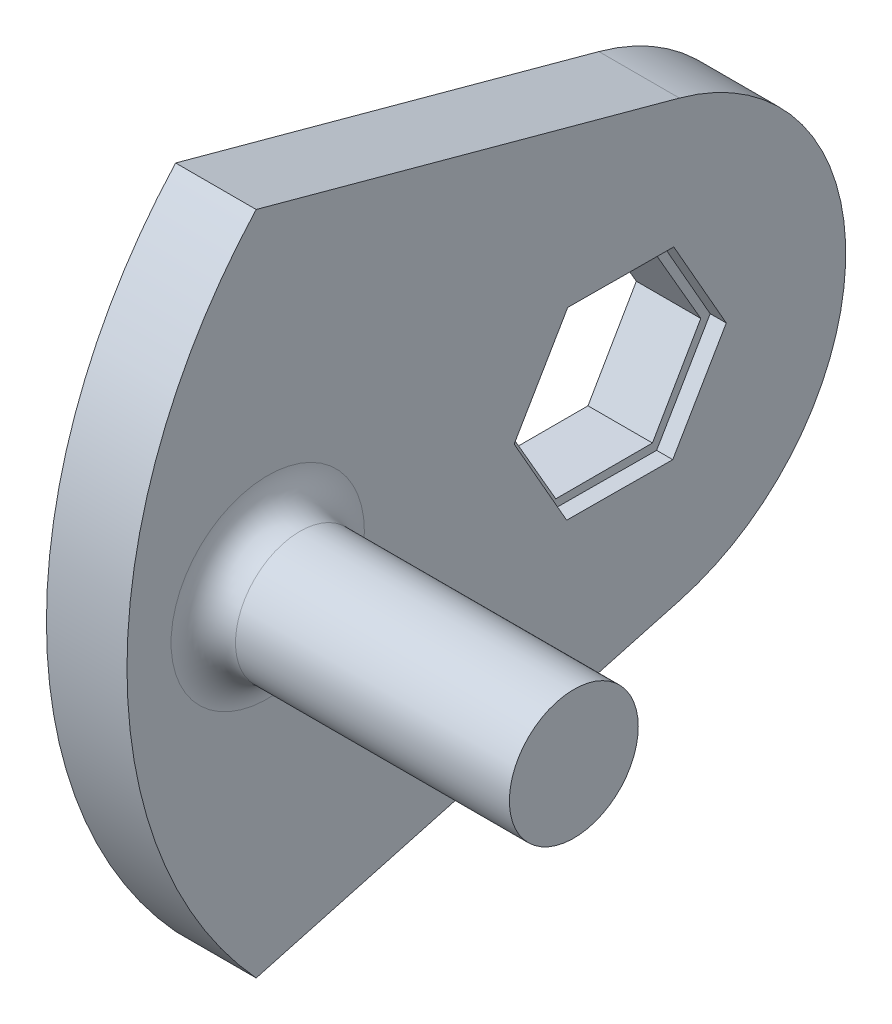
ISO-10303-21;
HEADER;
FILE_DESCRIPTION(('STEP AP214'),'2;1');
FILE_NAME('part.step','',(''),(''),'','','');
FILE_SCHEMA(('AUTOMOTIVE_DESIGN { 1 0 10303 214 1 1 1 1 }'));
ENDSEC;
DATA;
#1=APPLICATION_CONTEXT('core data for automotive mechanical design processes');
#2=APPLICATION_PROTOCOL_DEFINITION('international standard','automotive_design',2000,#1);
#3=PRODUCT_CONTEXT('',#1,'mechanical');
#4=PRODUCT('Part','Part','',(#3));
#5=PRODUCT_RELATED_PRODUCT_CATEGORY('part','',(#4));
#6=PRODUCT_DEFINITION_FORMATION('','',#4);
#7=PRODUCT_DEFINITION_CONTEXT('part definition',#1,'design');
#8=PRODUCT_DEFINITION('design','',#6,#7);
#9=PRODUCT_DEFINITION_SHAPE('','',#8);
#10=(LENGTH_UNIT() NAMED_UNIT(*) SI_UNIT(.MILLI.,.METRE.));
#11=(NAMED_UNIT(*) PLANE_ANGLE_UNIT() SI_UNIT($,.RADIAN.));
#12=(NAMED_UNIT(*) SI_UNIT($,.STERADIAN.) SOLID_ANGLE_UNIT());
#13=UNCERTAINTY_MEASURE_WITH_UNIT(LENGTH_MEASURE(1.E-05),#10,'distance_accuracy_value','');
#14=(GEOMETRIC_REPRESENTATION_CONTEXT(3) GLOBAL_UNCERTAINTY_ASSIGNED_CONTEXT((#13)) GLOBAL_UNIT_ASSIGNED_CONTEXT((#10,
#11,#12)) REPRESENTATION_CONTEXT('',''));
#15=CARTESIAN_POINT('',(0.,0.,0.));
#16=DIRECTION('',(0.,0.,1.));
#17=DIRECTION('',(1.,0.,0.));
#18=AXIS2_PLACEMENT_3D('',#15,#16,#17);
#19=CARTESIAN_POINT('',(5.,5.19615242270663,0.));
#20=DIRECTION('',(0.,-1.,0.));
#21=DIRECTION('',(0.,0.,-1.));
#22=AXIS2_PLACEMENT_3D('',#19,#20,#21);
#23=PLANE('',#22);
#24=DIRECTION('',(-1.,0.,0.));
#25=VECTOR('',#24,1.);
#26=CARTESIAN_POINT('',(5.,5.19615242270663,-3.));
#27=LINE('',#26,#25);
#28=CARTESIAN_POINT('',(4.,5.19615242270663,-3.));
#29=VERTEX_POINT('',#28);
#30=CARTESIAN_POINT('',(0.,5.19615242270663,-3.));
#31=VERTEX_POINT('',#30);
#32=EDGE_CURVE('E261',#29,#31,#27,.T.);
#33=ORIENTED_EDGE('',*,*,#32,.F.);
#34=DIRECTION('',(0.,0.,1.));
#35=VECTOR('',#34,1.);
#36=CARTESIAN_POINT('',(4.,5.19615242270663,0.));
#37=LINE('',#36,#35);
#38=CARTESIAN_POINT('',(4.,5.19615242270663,3.));
#39=VERTEX_POINT('',#38);
#40=EDGE_CURVE('E214',#29,#39,#37,.T.);
#41=ORIENTED_EDGE('',*,*,#40,.T.);
#42=DIRECTION('',(-1.,0.,0.));
#43=VECTOR('',#42,1.);
#44=CARTESIAN_POINT('',(5.,5.19615242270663,3.));
#45=LINE('',#44,#43);
#46=CARTESIAN_POINT('',(0.,5.19615242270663,3.));
#47=VERTEX_POINT('',#46);
#48=EDGE_CURVE('E231',#39,#47,#45,.T.);
#49=ORIENTED_EDGE('',*,*,#48,.T.);
#50=DIRECTION('',(0.,0.,1.));
#51=VECTOR('',#50,1.);
#52=CARTESIAN_POINT('',(0.,5.19615242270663,0.));
#53=LINE('',#52,#51);
#54=EDGE_CURVE('E220',#31,#47,#53,.T.);
#55=ORIENTED_EDGE('',*,*,#54,.F.);
#56=EDGE_LOOP('',(#33,#41,#49,#55));
#57=FACE_BOUND('',#56,.T.);
#58=ADVANCED_FACE('F38',(#57),#23,.T.);
#59=CARTESIAN_POINT('',(5.,2.59807621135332,-4.5));
#60=DIRECTION('',(0.,-0.5,0.866025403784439));
#61=DIRECTION('',(0.,-0.866025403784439,-0.5));
#62=AXIS2_PLACEMENT_3D('',#59,#60,#61);
#63=PLANE('',#62);
#64=DIRECTION('',(-1.,0.,0.));
#65=VECTOR('',#64,1.);
#66=CARTESIAN_POINT('',(5.,0.,-6.));
#67=LINE('',#66,#65);
#68=CARTESIAN_POINT('',(4.,0.,-6.));
#69=VERTEX_POINT('',#68);
#70=CARTESIAN_POINT('',(0.,0.,-6.));
#71=VERTEX_POINT('',#70);
#72=EDGE_CURVE('E278',#69,#71,#67,.T.);
#73=ORIENTED_EDGE('',*,*,#72,.F.);
#74=DIRECTION('',(0.,0.866025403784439,0.5));
#75=VECTOR('',#74,1.);
#76=CARTESIAN_POINT('',(4.,2.59807621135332,-4.5));
#77=LINE('',#76,#75);
#78=EDGE_CURVE('E211',#69,#29,#77,.T.);
#79=ORIENTED_EDGE('',*,*,#78,.T.);
#80=ORIENTED_EDGE('',*,*,#32,.T.);
#81=DIRECTION('',(0.,0.866025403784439,0.5));
#82=VECTOR('',#81,1.);
#83=CARTESIAN_POINT('',(0.,2.59807621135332,-4.5));
#84=LINE('',#83,#82);
#85=EDGE_CURVE('E234',#71,#31,#84,.T.);
#86=ORIENTED_EDGE('',*,*,#85,.F.);
#87=EDGE_LOOP('',(#73,#79,#80,#86));
#88=FACE_BOUND('',#87,.T.);
#89=ADVANCED_FACE('F343',(#88),#63,.T.);
#90=CARTESIAN_POINT('',(5.,-2.59807621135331,-4.5));
#91=DIRECTION('',(0.,0.5,0.866025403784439));
#92=DIRECTION('',(0.,-0.866025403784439,0.5));
#93=AXIS2_PLACEMENT_3D('',#90,#91,#92);
#94=PLANE('',#93);
#95=DIRECTION('',(-1.,0.,0.));
#96=VECTOR('',#95,1.);
#97=CARTESIAN_POINT('',(5.,-5.19615242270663,-3.));
#98=LINE('',#97,#96);
#99=CARTESIAN_POINT('',(4.,-5.19615242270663,-3.));
#100=VERTEX_POINT('',#99);
#101=CARTESIAN_POINT('',(0.,-5.19615242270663,-3.));
#102=VERTEX_POINT('',#101);
#103=EDGE_CURVE('E276',#100,#102,#98,.T.);
#104=ORIENTED_EDGE('',*,*,#103,.F.);
#105=DIRECTION('',(0.,0.866025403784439,-0.5));
#106=VECTOR('',#105,1.);
#107=CARTESIAN_POINT('',(4.,-2.59807621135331,-4.5));
#108=LINE('',#107,#106);
#109=EDGE_CURVE('E208',#100,#69,#108,.T.);
#110=ORIENTED_EDGE('',*,*,#109,.T.);
#111=ORIENTED_EDGE('',*,*,#72,.T.);
#112=DIRECTION('',(0.,0.866025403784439,-0.5));
#113=VECTOR('',#112,1.);
#114=CARTESIAN_POINT('',(0.,-2.59807621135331,-4.5));
#115=LINE('',#114,#113);
#116=EDGE_CURVE('E237',#102,#71,#115,.T.);
#117=ORIENTED_EDGE('',*,*,#116,.F.);
#118=EDGE_LOOP('',(#104,#110,#111,#117));
#119=FACE_BOUND('',#118,.T.);
#120=ADVANCED_FACE('F340',(#119),#94,.T.);
#121=CARTESIAN_POINT('',(5.,-5.19615242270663,0.));
#122=DIRECTION('',(0.,1.,0.));
#123=DIRECTION('',(0.,0.,1.));
#124=AXIS2_PLACEMENT_3D('',#121,#122,#123);
#125=PLANE('',#124);
#126=DIRECTION('',(-1.,0.,0.));
#127=VECTOR('',#126,1.);
#128=CARTESIAN_POINT('',(5.,-5.19615242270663,3.));
#129=LINE('',#128,#127);
#130=CARTESIAN_POINT('',(4.,-5.19615242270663,3.));
#131=VERTEX_POINT('',#130);
#132=CARTESIAN_POINT('',(0.,-5.19615242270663,3.));
#133=VERTEX_POINT('',#132);
#134=EDGE_CURVE('E274',#131,#133,#129,.T.);
#135=ORIENTED_EDGE('',*,*,#134,.F.);
#136=DIRECTION('',(0.,0.,-1.));
#137=VECTOR('',#136,1.);
#138=CARTESIAN_POINT('',(4.,-5.19615242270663,0.));
#139=LINE('',#138,#137);
#140=EDGE_CURVE('E205',#131,#100,#139,.T.);
#141=ORIENTED_EDGE('',*,*,#140,.T.);
#142=ORIENTED_EDGE('',*,*,#103,.T.);
#143=DIRECTION('',(0.,0.,-1.));
#144=VECTOR('',#143,1.);
#145=CARTESIAN_POINT('',(0.,-5.19615242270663,0.));
#146=LINE('',#145,#144);
#147=EDGE_CURVE('E240',#133,#102,#146,.T.);
#148=ORIENTED_EDGE('',*,*,#147,.F.);
#149=EDGE_LOOP('',(#135,#141,#142,#148));
#150=FACE_BOUND('',#149,.T.);
#151=ADVANCED_FACE('F337',(#150),#125,.T.);
#152=CARTESIAN_POINT('',(5.,-2.59807621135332,4.5));
#153=DIRECTION('',(0.,0.5,-0.866025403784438));
#154=DIRECTION('',(0.,0.866025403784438,0.5));
#155=AXIS2_PLACEMENT_3D('',#152,#153,#154);
#156=PLANE('',#155);
#157=DIRECTION('',(-1.,0.,0.));
#158=VECTOR('',#157,1.);
#159=CARTESIAN_POINT('',(5.,0.,6.));
#160=LINE('',#159,#158);
#161=CARTESIAN_POINT('',(4.,0.,6.));
#162=VERTEX_POINT('',#161);
#163=CARTESIAN_POINT('',(0.,0.,6.));
#164=VERTEX_POINT('',#163);
#165=EDGE_CURVE('E272',#162,#164,#160,.T.);
#166=ORIENTED_EDGE('',*,*,#165,.F.);
#167=DIRECTION('',(0.,-0.866025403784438,-0.5));
#168=VECTOR('',#167,1.);
#169=CARTESIAN_POINT('',(4.,-2.59807621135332,4.5));
#170=LINE('',#169,#168);
#171=EDGE_CURVE('E61',#162,#131,#170,.T.);
#172=ORIENTED_EDGE('',*,*,#171,.T.);
#173=ORIENTED_EDGE('',*,*,#134,.T.);
#174=DIRECTION('',(0.,-0.866025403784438,-0.5));
#175=VECTOR('',#174,1.);
#176=CARTESIAN_POINT('',(0.,-2.59807621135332,4.5));
#177=LINE('',#176,#175);
#178=EDGE_CURVE('E243',#164,#133,#177,.T.);
#179=ORIENTED_EDGE('',*,*,#178,.F.);
#180=EDGE_LOOP('',(#166,#172,#173,#179));
#181=FACE_BOUND('',#180,.T.);
#182=ADVANCED_FACE('F332',(#181),#156,.T.);
#183=CARTESIAN_POINT('',(5.,2.59807621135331,4.5));
#184=DIRECTION('',(0.,-0.5,-0.866025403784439));
#185=DIRECTION('',(0.,0.866025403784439,-0.5));
#186=AXIS2_PLACEMENT_3D('',#183,#184,#185);
#187=PLANE('',#186);
#188=ORIENTED_EDGE('',*,*,#48,.F.);
#189=DIRECTION('',(0.,-0.866025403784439,0.5));
#190=VECTOR('',#189,1.);
#191=CARTESIAN_POINT('',(4.,2.59807621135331,4.5));
#192=LINE('',#191,#190);
#193=EDGE_CURVE('E11',#39,#162,#192,.T.);
#194=ORIENTED_EDGE('',*,*,#193,.T.);
#195=ORIENTED_EDGE('',*,*,#165,.T.);
#196=DIRECTION('',(0.,-0.866025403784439,0.5));
#197=VECTOR('',#196,1.);
#198=CARTESIAN_POINT('',(0.,2.59807621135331,4.5));
#199=LINE('',#198,#197);
#200=EDGE_CURVE('E246',#47,#164,#199,.T.);
#201=ORIENTED_EDGE('',*,*,#200,.F.);
#202=EDGE_LOOP('',(#188,#194,#195,#201));
#203=FACE_BOUND('',#202,.T.);
#204=ADVANCED_FACE('F297',(#203),#187,.T.);
#205=CARTESIAN_POINT('',(5.,0.,0.));
#206=DIRECTION('',(1.,0.,0.));
#207=DIRECTION('',(0.,0.,-1.));
#208=AXIS2_PLACEMENT_3D('',#205,#206,#207);
#209=PLANE('',#208);
#210=DIRECTION('',(0.,0.868831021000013,0.495108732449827));
#211=VECTOR('',#210,1.);
#212=CARTESIAN_POINT('',(5.,-0.037123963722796,-6.5835935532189));
#213=LINE('',#212,#211);
#214=CARTESIAN_POINT('',(5.,-0.037123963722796,-6.5835935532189));
#215=VERTEX_POINT('',#214);
#216=CARTESIAN_POINT('',(5.,5.68299728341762,-3.32394707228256));
#217=VERTEX_POINT('',#216);
#218=EDGE_CURVE('E53',#215,#217,#213,.T.);
#219=ORIENTED_EDGE('',*,*,#218,.F.);
#220=DIRECTION('',(0.,0.86319225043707,-0.504875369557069));
#221=VECTOR('',#220,1.);
#222=CARTESIAN_POINT('',(5.,-5.72012124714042,-3.25964648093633));
#223=LINE('',#222,#221);
#224=CARTESIAN_POINT('',(5.,-5.72012124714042,-3.25964648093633));
#225=VERTEX_POINT('',#224);
#226=EDGE_CURVE('E171',#225,#215,#223,.T.);
#227=ORIENTED_EDGE('',*,*,#226,.F.);
#228=DIRECTION('',(0.,-0.00563877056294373,-0.999984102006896));
#229=VECTOR('',#228,1.);
#230=CARTESIAN_POINT('',(5.,-5.68299728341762,3.32394707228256));
#231=LINE('',#230,#229);
#232=CARTESIAN_POINT('',(5.,-5.68299728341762,3.32394707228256));
#233=VERTEX_POINT('',#232);
#234=EDGE_CURVE('E174',#233,#225,#231,.T.);
#235=ORIENTED_EDGE('',*,*,#234,.F.);
#236=DIRECTION('',(0.,-0.868831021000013,-0.495108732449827));
#237=VECTOR('',#236,1.);
#238=CARTESIAN_POINT('',(5.,0.0371239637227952,6.58359355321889));
#239=LINE('',#238,#237);
#240=CARTESIAN_POINT('',(5.,0.0371239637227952,6.58359355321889));
#241=VERTEX_POINT('',#240);
#242=EDGE_CURVE('E190',#241,#233,#239,.T.);
#243=ORIENTED_EDGE('',*,*,#242,.F.);
#244=DIRECTION('',(0.,-0.86319225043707,0.504875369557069));
#245=VECTOR('',#244,1.);
#246=CARTESIAN_POINT('',(5.,5.72012124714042,3.25964648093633));
#247=LINE('',#246,#245);
#248=CARTESIAN_POINT('',(5.,5.72012124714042,3.25964648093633));
#249=VERTEX_POINT('',#248);
#250=EDGE_CURVE('E187',#249,#241,#247,.T.);
#251=ORIENTED_EDGE('',*,*,#250,.F.);
#252=DIRECTION('',(0.,0.00563877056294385,0.999984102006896));
#253=VECTOR('',#252,1.);
#254=CARTESIAN_POINT('',(5.,5.68299728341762,-3.32394707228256));
#255=LINE('',#254,#253);
#256=EDGE_CURVE('E185',#217,#249,#255,.T.);
#257=ORIENTED_EDGE('',*,*,#256,.F.);
#258=EDGE_LOOP('',(#219,#227,#235,#243,#251,#257));
#259=FACE_BOUND('',#258,.T.);
#260=CARTESIAN_POINT('',(5.,0.,21.88));
#261=DIRECTION('',(1.,0.,0.));
#262=DIRECTION('',(0.,0.,-1.));
#263=AXIS2_PLACEMENT_3D('',#260,#261,#262);
#264=CIRCLE('',#263,6.);
#265=CARTESIAN_POINT('',(5.,0.,15.88));
#266=VERTEX_POINT('',#265);
#267=EDGE_CURVE('E270',#266,#266,#264,.F.);
#268=ORIENTED_EDGE('',*,*,#267,.T.);
#269=EDGE_LOOP('',(#268));
#270=FACE_BOUND('',#269,.T.);
#271=DIRECTION('',(0.,0.262500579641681,0.964931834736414));
#272=VECTOR('',#271,1.);
#273=CARTESIAN_POINT('',(5.,13.5090456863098,-3.67500811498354));
#274=LINE('',#273,#272);
#275=CARTESIAN_POINT('',(5.,13.5090456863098,-3.67500811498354));
#276=VERTEX_POINT('',#275);
#277=CARTESIAN_POINT('',(5.,20.6562419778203,22.5975328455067));
#278=VERTEX_POINT('',#277);
#279=EDGE_CURVE('E221',#276,#278,#274,.T.);
#280=ORIENTED_EDGE('',*,*,#279,.T.);
#281=CARTESIAN_POINT('',(5.,0.,0.));
#282=DIRECTION('',(1.,0.,0.));
#283=DIRECTION('',(0.,0.,-1.));
#284=AXIS2_PLACEMENT_3D('',#281,#282,#283);
#285=CIRCLE('',#284,30.6158263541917);
#286=CARTESIAN_POINT('',(5.,-20.6562419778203,22.5975328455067));
#287=VERTEX_POINT('',#286);
#288=EDGE_CURVE('E224',#278,#287,#285,.T.);
#289=ORIENTED_EDGE('',*,*,#288,.T.);
#290=DIRECTION('',(0.,0.262500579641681,-0.964931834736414));
#291=VECTOR('',#290,1.);
#292=CARTESIAN_POINT('',(5.,-13.5090456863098,-3.67500811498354));
#293=LINE('',#292,#291);
#294=CARTESIAN_POINT('',(5.,-13.5090456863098,-3.67500811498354));
#295=VERTEX_POINT('',#294);
#296=EDGE_CURVE('E227',#287,#295,#293,.T.);
#297=ORIENTED_EDGE('',*,*,#296,.T.);
#298=CARTESIAN_POINT('',(5.,0.,0.));
#299=DIRECTION('',(1.,0.,0.));
#300=DIRECTION('',(0.,0.,-1.));
#301=AXIS2_PLACEMENT_3D('',#298,#299,#300);
#302=CIRCLE('',#301,14.);
#303=EDGE_CURVE('E229',#295,#276,#302,.T.);
#304=ORIENTED_EDGE('',*,*,#303,.T.);
#305=EDGE_LOOP('',(#280,#289,#297,#304));
#306=FACE_BOUND('',#305,.T.);
#307=ADVANCED_FACE('F293',(#259,#270,#306),#209,.T.);
#308=CARTESIAN_POINT('',(5.,13.5090456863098,-3.67500811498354));
#309=DIRECTION('',(0.,-0.964931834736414,0.262500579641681));
#310=DIRECTION('',(0.,-0.262500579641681,-0.964931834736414));
#311=AXIS2_PLACEMENT_3D('',#308,#309,#310);
#312=PLANE('',#311);
#313=DIRECTION('',(0.,0.262500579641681,0.964931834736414));
#314=VECTOR('',#313,1.);
#315=CARTESIAN_POINT('',(0.,13.5090456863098,-3.67500811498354));
#316=LINE('',#315,#314);
#317=CARTESIAN_POINT('',(0.,13.5090456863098,-3.67500811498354));
#318=VERTEX_POINT('',#317);
#319=CARTESIAN_POINT('',(0.,20.6562419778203,22.5975328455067));
#320=VERTEX_POINT('',#319);
#321=EDGE_CURVE('E249',#318,#320,#316,.T.);
#322=ORIENTED_EDGE('',*,*,#321,.T.);
#323=DIRECTION('',(-1.,0.,0.));
#324=VECTOR('',#323,1.);
#325=CARTESIAN_POINT('',(5.,20.6562419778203,22.5975328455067));
#326=LINE('',#325,#324);
#327=EDGE_CURVE('E267',#278,#320,#326,.T.);
#328=ORIENTED_EDGE('',*,*,#327,.F.);
#329=ORIENTED_EDGE('',*,*,#279,.F.);
#330=DIRECTION('',(-1.,0.,0.));
#331=VECTOR('',#330,1.);
#332=CARTESIAN_POINT('',(5.,13.5090456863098,-3.67500811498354));
#333=LINE('',#332,#331);
#334=EDGE_CURVE('E257',#276,#318,#333,.T.);
#335=ORIENTED_EDGE('',*,*,#334,.T.);
#336=EDGE_LOOP('',(#322,#328,#329,#335));
#337=FACE_BOUND('',#336,.T.);
#338=ADVANCED_FACE('F296',(#337),#312,.F.);
#339=CARTESIAN_POINT('',(5.,0.,0.));
#340=DIRECTION('',(-1.,0.,0.));
#341=DIRECTION('',(0.,0.,1.));
#342=AXIS2_PLACEMENT_3D('',#339,#340,#341);
#343=CYLINDRICAL_SURFACE('',#342,30.6158263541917);
#344=CARTESIAN_POINT('',(0.,0.,0.));
#345=DIRECTION('',(1.,0.,0.));
#346=DIRECTION('',(0.,0.,-1.));
#347=AXIS2_PLACEMENT_3D('',#344,#345,#346);
#348=CIRCLE('',#347,30.6158263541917);
#349=CARTESIAN_POINT('',(0.,-20.6562419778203,22.5975328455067));
#350=VERTEX_POINT('',#349);
#351=EDGE_CURVE('E252',#320,#350,#348,.T.);
#352=ORIENTED_EDGE('',*,*,#351,.T.);
#353=DIRECTION('',(-1.,0.,0.));
#354=VECTOR('',#353,1.);
#355=CARTESIAN_POINT('',(5.,-20.6562419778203,22.5975328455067));
#356=LINE('',#355,#354);
#357=EDGE_CURVE('E264',#287,#350,#356,.T.);
#358=ORIENTED_EDGE('',*,*,#357,.F.);
#359=ORIENTED_EDGE('',*,*,#288,.F.);
#360=ORIENTED_EDGE('',*,*,#327,.T.);
#361=EDGE_LOOP('',(#352,#358,#359,#360));
#362=FACE_BOUND('',#361,.T.);
#363=ADVANCED_FACE('F308',(#362),#343,.T.);
#364=CARTESIAN_POINT('',(5.,-13.5090456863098,-3.67500811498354));
#365=DIRECTION('',(0.,0.964931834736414,0.262500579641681));
#366=DIRECTION('',(0.,-0.262500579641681,0.964931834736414));
#367=AXIS2_PLACEMENT_3D('',#364,#365,#366);
#368=PLANE('',#367);
#369=DIRECTION('',(0.,0.262500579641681,-0.964931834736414));
#370=VECTOR('',#369,1.);
#371=CARTESIAN_POINT('',(0.,-13.5090456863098,-3.67500811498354));
#372=LINE('',#371,#370);
#373=CARTESIAN_POINT('',(0.,-13.5090456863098,-3.67500811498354));
#374=VERTEX_POINT('',#373);
#375=EDGE_CURVE('E254',#350,#374,#372,.T.);
#376=ORIENTED_EDGE('',*,*,#375,.T.);
#377=DIRECTION('',(-1.,0.,0.));
#378=VECTOR('',#377,1.);
#379=CARTESIAN_POINT('',(5.,-13.5090456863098,-3.67500811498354));
#380=LINE('',#379,#378);
#381=EDGE_CURVE('E260',#295,#374,#380,.T.);
#382=ORIENTED_EDGE('',*,*,#381,.F.);
#383=ORIENTED_EDGE('',*,*,#296,.F.);
#384=ORIENTED_EDGE('',*,*,#357,.T.);
#385=EDGE_LOOP('',(#376,#382,#383,#384));
#386=FACE_BOUND('',#385,.T.);
#387=ADVANCED_FACE('F313',(#386),#368,.F.);
#388=CARTESIAN_POINT('',(5.,0.,0.));
#389=DIRECTION('',(-1.,0.,0.));
#390=DIRECTION('',(0.,0.,1.));
#391=AXIS2_PLACEMENT_3D('',#388,#389,#390);
#392=CYLINDRICAL_SURFACE('',#391,14.);
#393=CARTESIAN_POINT('',(0.,0.,0.));
#394=DIRECTION('',(1.,0.,0.));
#395=DIRECTION('',(0.,0.,-1.));
#396=AXIS2_PLACEMENT_3D('',#393,#394,#395);
#397=CIRCLE('',#396,14.);
#398=EDGE_CURVE('E225',#374,#318,#397,.T.);
#399=ORIENTED_EDGE('',*,*,#398,.T.);
#400=ORIENTED_EDGE('',*,*,#334,.F.);
#401=ORIENTED_EDGE('',*,*,#303,.F.);
#402=ORIENTED_EDGE('',*,*,#381,.T.);
#403=EDGE_LOOP('',(#399,#400,#401,#402));
#404=FACE_BOUND('',#403,.T.);
#405=ADVANCED_FACE('F316',(#404),#392,.T.);
#406=CARTESIAN_POINT('',(0.,0.,0.));
#407=DIRECTION('',(1.,0.,0.));
#408=DIRECTION('',(0.,0.,-1.));
#409=AXIS2_PLACEMENT_3D('',#406,#407,#408);
#410=PLANE('',#409);
#411=ORIENTED_EDGE('',*,*,#321,.F.);
#412=ORIENTED_EDGE('',*,*,#398,.F.);
#413=ORIENTED_EDGE('',*,*,#375,.F.);
#414=ORIENTED_EDGE('',*,*,#351,.F.);
#415=EDGE_LOOP('',(#411,#412,#413,#414));
#416=FACE_BOUND('',#415,.T.);
#417=ORIENTED_EDGE('',*,*,#54,.T.);
#418=ORIENTED_EDGE('',*,*,#200,.T.);
#419=ORIENTED_EDGE('',*,*,#178,.T.);
#420=ORIENTED_EDGE('',*,*,#147,.T.);
#421=ORIENTED_EDGE('',*,*,#116,.T.);
#422=ORIENTED_EDGE('',*,*,#85,.T.);
#423=EDGE_LOOP('',(#417,#418,#419,#420,#421,#422));
#424=FACE_BOUND('',#423,.T.);
#425=ADVANCED_FACE('F318',(#416,#424),#410,.F.);
#426=CARTESIAN_POINT('',(24.,0.,21.88));
#427=DIRECTION('',(-1.,0.,0.));
#428=DIRECTION('',(0.,0.,1.));
#429=AXIS2_PLACEMENT_3D('',#426,#427,#428);
#430=CYLINDRICAL_SURFACE('',#429,4.);
#431=CARTESIAN_POINT('',(7.,0.,21.88));
#432=DIRECTION('',(1.,0.,0.));
#433=DIRECTION('',(0.,0.,-1.));
#434=AXIS2_PLACEMENT_3D('',#431,#432,#433);
#435=CIRCLE('',#434,4.);
#436=CARTESIAN_POINT('',(7.,0.,17.88));
#437=VERTEX_POINT('',#436);
#438=EDGE_CURVE('E46',#437,#437,#435,.T.);
#439=ORIENTED_EDGE('',*,*,#438,.T.);
#440=EDGE_LOOP('',(#439));
#441=FACE_BOUND('',#440,.T.);
#442=CARTESIAN_POINT('',(24.,0.,21.88));
#443=DIRECTION('',(1.,0.,0.));
#444=DIRECTION('',(0.,0.,-1.));
#445=AXIS2_PLACEMENT_3D('',#442,#443,#444);
#446=CIRCLE('',#445,4.);
#447=CARTESIAN_POINT('',(24.,0.,17.88));
#448=VERTEX_POINT('',#447);
#449=EDGE_CURVE('E217',#448,#448,#446,.T.);
#450=ORIENTED_EDGE('',*,*,#449,.F.);
#451=EDGE_LOOP('',(#450));
#452=FACE_BOUND('',#451,.T.);
#453=ADVANCED_FACE('F285',(#441,#452),#430,.T.);
#454=CARTESIAN_POINT('',(24.,0.,21.88));
#455=DIRECTION('',(1.,0.,0.));
#456=DIRECTION('',(0.,0.,-1.));
#457=AXIS2_PLACEMENT_3D('',#454,#455,#456);
#458=PLANE('',#457);
#459=ORIENTED_EDGE('',*,*,#449,.T.);
#460=EDGE_LOOP('',(#459));
#461=FACE_BOUND('',#460,.T.);
#462=ADVANCED_FACE('F290',(#461),#458,.T.);
#463=CARTESIAN_POINT('',(7.,0.,21.88));
#464=DIRECTION('',(1.,0.,0.));
#465=DIRECTION('',(0.,0.,-1.));
#466=AXIS2_PLACEMENT_3D('',#463,#464,#465);
#467=TOROIDAL_SURFACE('',#466,6.,2.);
#468=ORIENTED_EDGE('',*,*,#438,.F.);
#469=EDGE_LOOP('',(#468));
#470=FACE_BOUND('',#469,.T.);
#471=ORIENTED_EDGE('',*,*,#267,.F.);
#472=EDGE_LOOP('',(#471));
#473=FACE_BOUND('',#472,.T.);
#474=ADVANCED_FACE('F40',(#470,#473),#467,.F.);
#475=CARTESIAN_POINT('',(4.,-0.037123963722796,-6.5835935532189));
#476=DIRECTION('',(0.,0.495108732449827,-0.868831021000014));
#477=DIRECTION('',(0.,0.868831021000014,0.495108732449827));
#478=AXIS2_PLACEMENT_3D('',#475,#476,#477);
#479=PLANE('',#478);
#480=ORIENTED_EDGE('',*,*,#218,.T.);
#481=DIRECTION('',(1.,0.,0.));
#482=VECTOR('',#481,1.);
#483=CARTESIAN_POINT('',(4.,5.68299728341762,-3.32394707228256));
#484=LINE('',#483,#482);
#485=CARTESIAN_POINT('',(4.,5.68299728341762,-3.32394707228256));
#486=VERTEX_POINT('',#485);
#487=EDGE_CURVE('E148',#486,#217,#484,.T.);
#488=ORIENTED_EDGE('',*,*,#487,.F.);
#489=DIRECTION('',(0.,0.868831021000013,0.495108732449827));
#490=VECTOR('',#489,1.);
#491=CARTESIAN_POINT('',(4.,-0.037123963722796,-6.5835935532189));
#492=LINE('',#491,#490);
#493=CARTESIAN_POINT('',(4.,-0.037123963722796,-6.5835935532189));
#494=VERTEX_POINT('',#493);
#495=EDGE_CURVE('E152',#494,#486,#492,.T.);
#496=ORIENTED_EDGE('',*,*,#495,.F.);
#497=DIRECTION('',(1.,0.,0.));
#498=VECTOR('',#497,1.);
#499=CARTESIAN_POINT('',(4.,-0.037123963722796,-6.5835935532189));
#500=LINE('',#499,#498);
#501=EDGE_CURVE('E195',#494,#215,#500,.T.);
#502=ORIENTED_EDGE('',*,*,#501,.T.);
#503=EDGE_LOOP('',(#480,#488,#496,#502));
#504=FACE_BOUND('',#503,.T.);
#505=ADVANCED_FACE('F150',(#504),#479,.F.);
#506=CARTESIAN_POINT('',(4.,-5.72012124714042,-3.25964648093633));
#507=DIRECTION('',(0.,-0.504875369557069,-0.86319225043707));
#508=DIRECTION('',(0.,0.86319225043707,-0.504875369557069));
#509=AXIS2_PLACEMENT_3D('',#506,#507,#508);
#510=PLANE('',#509);
#511=ORIENTED_EDGE('',*,*,#226,.T.);
#512=ORIENTED_EDGE('',*,*,#501,.F.);
#513=DIRECTION('',(0.,0.86319225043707,-0.504875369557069));
#514=VECTOR('',#513,1.);
#515=CARTESIAN_POINT('',(4.,-5.72012124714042,-3.25964648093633));
#516=LINE('',#515,#514);
#517=CARTESIAN_POINT('',(4.,-5.72012124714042,-3.25964648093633));
#518=VERTEX_POINT('',#517);
#519=EDGE_CURVE('E158',#518,#494,#516,.T.);
#520=ORIENTED_EDGE('',*,*,#519,.F.);
#521=DIRECTION('',(1.,0.,0.));
#522=VECTOR('',#521,1.);
#523=CARTESIAN_POINT('',(4.,-5.72012124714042,-3.25964648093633));
#524=LINE('',#523,#522);
#525=EDGE_CURVE('E197',#518,#225,#524,.T.);
#526=ORIENTED_EDGE('',*,*,#525,.T.);
#527=EDGE_LOOP('',(#511,#512,#520,#526));
#528=FACE_BOUND('',#527,.T.);
#529=ADVANCED_FACE('F380',(#528),#510,.F.);
#530=CARTESIAN_POINT('',(4.,-5.68299728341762,3.32394707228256));
#531=DIRECTION('',(0.,-0.999984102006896,0.00563877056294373));
#532=DIRECTION('',(0.,-0.00563877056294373,-0.999984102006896));
#533=AXIS2_PLACEMENT_3D('',#530,#531,#532);
#534=PLANE('',#533);
#535=ORIENTED_EDGE('',*,*,#234,.T.);
#536=ORIENTED_EDGE('',*,*,#525,.F.);
#537=DIRECTION('',(0.,-0.00563877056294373,-0.999984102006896));
#538=VECTOR('',#537,1.);
#539=CARTESIAN_POINT('',(4.,-5.68299728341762,3.32394707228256));
#540=LINE('',#539,#538);
#541=CARTESIAN_POINT('',(4.,-5.68299728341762,3.32394707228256));
#542=VERTEX_POINT('',#541);
#543=EDGE_CURVE('E181',#542,#518,#540,.T.);
#544=ORIENTED_EDGE('',*,*,#543,.F.);
#545=DIRECTION('',(1.,0.,0.));
#546=VECTOR('',#545,1.);
#547=CARTESIAN_POINT('',(4.,-5.68299728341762,3.32394707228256));
#548=LINE('',#547,#546);
#549=EDGE_CURVE('E199',#542,#233,#548,.T.);
#550=ORIENTED_EDGE('',*,*,#549,.T.);
#551=EDGE_LOOP('',(#535,#536,#544,#550));
#552=FACE_BOUND('',#551,.T.);
#553=ADVANCED_FACE('F388',(#552),#534,.F.);
#554=CARTESIAN_POINT('',(4.,0.0371239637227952,6.58359355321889));
#555=DIRECTION('',(0.,-0.495108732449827,0.868831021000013));
#556=DIRECTION('',(0.,-0.868831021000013,-0.495108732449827));
#557=AXIS2_PLACEMENT_3D('',#554,#555,#556);
#558=PLANE('',#557);
#559=ORIENTED_EDGE('',*,*,#242,.T.);
#560=ORIENTED_EDGE('',*,*,#549,.F.);
#561=DIRECTION('',(0.,-0.868831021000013,-0.495108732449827));
#562=VECTOR('',#561,1.);
#563=CARTESIAN_POINT('',(4.,0.0371239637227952,6.58359355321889));
#564=LINE('',#563,#562);
#565=CARTESIAN_POINT('',(4.,0.0371239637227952,6.58359355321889));
#566=VERTEX_POINT('',#565);
#567=EDGE_CURVE('E178',#566,#542,#564,.T.);
#568=ORIENTED_EDGE('',*,*,#567,.F.);
#569=DIRECTION('',(1.,0.,0.));
#570=VECTOR('',#569,1.);
#571=CARTESIAN_POINT('',(4.,0.0371239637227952,6.58359355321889));
#572=LINE('',#571,#570);
#573=EDGE_CURVE('E201',#566,#241,#572,.T.);
#574=ORIENTED_EDGE('',*,*,#573,.T.);
#575=EDGE_LOOP('',(#559,#560,#568,#574));
#576=FACE_BOUND('',#575,.T.);
#577=ADVANCED_FACE('F384',(#576),#558,.F.);
#578=CARTESIAN_POINT('',(4.,5.72012124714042,3.25964648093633));
#579=DIRECTION('',(0.,0.504875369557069,0.86319225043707));
#580=DIRECTION('',(0.,-0.86319225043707,0.504875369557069));
#581=AXIS2_PLACEMENT_3D('',#578,#579,#580);
#582=PLANE('',#581);
#583=ORIENTED_EDGE('',*,*,#250,.T.);
#584=ORIENTED_EDGE('',*,*,#573,.F.);
#585=DIRECTION('',(0.,-0.86319225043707,0.504875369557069));
#586=VECTOR('',#585,1.);
#587=CARTESIAN_POINT('',(4.,5.72012124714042,3.25964648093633));
#588=LINE('',#587,#586);
#589=CARTESIAN_POINT('',(4.,5.72012124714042,3.25964648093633));
#590=VERTEX_POINT('',#589);
#591=EDGE_CURVE('E166',#590,#566,#588,.T.);
#592=ORIENTED_EDGE('',*,*,#591,.F.);
#593=DIRECTION('',(1.,0.,0.));
#594=VECTOR('',#593,1.);
#595=CARTESIAN_POINT('',(4.,5.72012124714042,3.25964648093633));
#596=LINE('',#595,#594);
#597=EDGE_CURVE('E157',#590,#249,#596,.T.);
#598=ORIENTED_EDGE('',*,*,#597,.T.);
#599=EDGE_LOOP('',(#583,#584,#592,#598));
#600=FACE_BOUND('',#599,.T.);
#601=ADVANCED_FACE('F349',(#600),#582,.F.);
#602=CARTESIAN_POINT('',(4.,5.68299728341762,-3.32394707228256));
#603=DIRECTION('',(0.,0.999984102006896,-0.00563877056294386));
#604=DIRECTION('',(0.,0.00563877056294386,0.999984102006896));
#605=AXIS2_PLACEMENT_3D('',#602,#603,#604);
#606=PLANE('',#605);
#607=ORIENTED_EDGE('',*,*,#256,.T.);
#608=ORIENTED_EDGE('',*,*,#597,.F.);
#609=DIRECTION('',(0.,0.00563877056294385,0.999984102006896));
#610=VECTOR('',#609,1.);
#611=CARTESIAN_POINT('',(4.,5.68299728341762,-3.32394707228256));
#612=LINE('',#611,#610);
#613=EDGE_CURVE('E161',#486,#590,#612,.T.);
#614=ORIENTED_EDGE('',*,*,#613,.F.);
#615=ORIENTED_EDGE('',*,*,#487,.T.);
#616=EDGE_LOOP('',(#607,#608,#614,#615));
#617=FACE_BOUND('',#616,.T.);
#618=ADVANCED_FACE('F162',(#617),#606,.F.);
#619=CARTESIAN_POINT('',(4.,0.,0.));
#620=DIRECTION('',(1.,0.,0.));
#621=DIRECTION('',(0.,0.,-1.));
#622=AXIS2_PLACEMENT_3D('',#619,#620,#621);
#623=PLANE('',#622);
#624=ORIENTED_EDGE('',*,*,#78,.F.);
#625=ORIENTED_EDGE('',*,*,#109,.F.);
#626=ORIENTED_EDGE('',*,*,#140,.F.);
#627=ORIENTED_EDGE('',*,*,#171,.F.);
#628=ORIENTED_EDGE('',*,*,#193,.F.);
#629=ORIENTED_EDGE('',*,*,#40,.F.);
#630=EDGE_LOOP('',(#624,#625,#626,#627,#628,#629));
#631=FACE_BOUND('',#630,.T.);
#632=ORIENTED_EDGE('',*,*,#495,.T.);
#633=ORIENTED_EDGE('',*,*,#613,.T.);
#634=ORIENTED_EDGE('',*,*,#591,.T.);
#635=ORIENTED_EDGE('',*,*,#567,.T.);
#636=ORIENTED_EDGE('',*,*,#543,.T.);
#637=ORIENTED_EDGE('',*,*,#519,.T.);
#638=EDGE_LOOP('',(#632,#633,#634,#635,#636,#637));
#639=FACE_BOUND('',#638,.T.);
#640=ADVANCED_FACE('F168',(#631,#639),#623,.T.);
#641=CLOSED_SHELL('',(#58,#89,#120,#151,#182,#204,#307,#338,#363,#387,#405,#425,#453,#462,#474,
#505,#529,#553,#577,#601,#618,#640));
#642=MANIFOLD_SOLID_BREP('B2',#641);
#643=ADVANCED_BREP_SHAPE_REPRESENTATION('',(#18,#642),#14);
#644=SHAPE_DEFINITION_REPRESENTATION(#9,#643);
ENDSEC;
END-ISO-10303-21;
